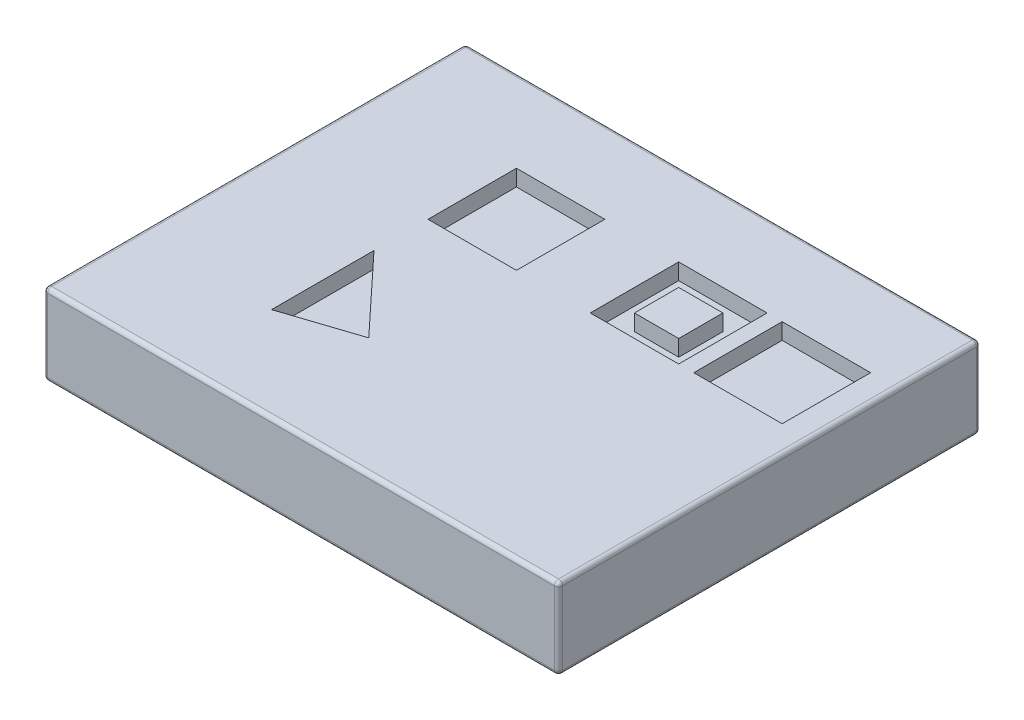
from build123d import *

# Parameters (mm, degrees)
SCHIZZO1_W                   = 63.465430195
SCHIZZO1_H                   = 52.006394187
ESTRUSIONE_ESTRUSIONE1_DEPTH = 10
SCHIZZO3_W                   = 10.899543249
SCHIZZO3_H                   = 10.899543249
SCHIZZO3_W_2                 = 5.449771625
SCHIZZO3_H_2                 = 5.449771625
SCHIZZO3_W_3                 = 10.89954325
TAGLIO_ESTRUSIONE1_DEPTH     = 2
RACCORDO3_R                  = 0.5


with BuildPart() as part:
    # Schizzo1 → Estrusione-Estrusione1 (new body)
    with BuildSketch(Plane(origin=(0, 0, 0), x_dir=(1, 0, 0), z_dir=(0, 1, 0))):
        with Locations((31.732715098, 26.003197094)):
            Rectangle(SCHIZZO1_W, SCHIZZO1_H)
    extrude(amount=ESTRUSIONE_ESTRUSIONE1_DEPTH)

    # Schizzo3 → Taglio-Estrusione1 (cut)
    # profile 1 of 4: a face of its own
    with BuildSketch(Plane(origin=(0, 10, 0), x_dir=(1, 0, 0), z_dir=(0, 1, 0))):
        with Locations((21.984557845, 36.298134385)):
            Rectangle(SCHIZZO3_W, SCHIZZO3_H)
    # profile 2 of 4: a face of its own
    with BuildSketch(Plane(origin=(0, 10, 0), x_dir=(1, 0, 0), z_dir=(0, 1, 0))):
        with Locations((41.984557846, 36.298134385)):
            Rectangle(SCHIZZO3_W, SCHIZZO3_H)
        with Locations((41.984557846, 36.298134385)):
            Rectangle(SCHIZZO3_W_2, SCHIZZO3_H_2, mode=Mode.SUBTRACT)
    # profile 3 of 4: a face of its own
    with BuildSketch(Plane(origin=(0, 10, 0), x_dir=(1, 0, 0), z_dir=(0, 1, 0))):
        Polygon((16.534786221, 11.562513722), (16.534786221, 24.191287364), (25.538140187, 14.538250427), align=None)
    # profile 4 of 4: a face of its own
    with BuildSketch(Plane(origin=(0, 10, 0), x_dir=(1, 0, 0), z_dir=(0, 1, 0))):
        with Locations((54.738899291, 36.298134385)):
            Rectangle(SCHIZZO3_W_3, SCHIZZO3_H)
    extrude(amount=-TAGLIO_ESTRUSIONE1_DEPTH, mode=Mode.SUBTRACT)

    # Raccordo3
    raccordo3_edges = [part.edges().sort_by_distance(p)[0] for p in [
        (63.465430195, 10, -26.003197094),
        (31.732715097, 10, -52.006394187),
        (0, 10, -26.003197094),
        (31.732715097, 0, -52.006394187),
        (63.465430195, 0, -26.003197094),
        (31.732715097, 0, 0),
        (0, 0, -26.003197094),
        (31.732715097, 10, 0),
        (0, 5, -52.006394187),
        (63.465430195, 5, -52.006394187),
        (63.465430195, 5, 0),
        (0, 5, 0),
    ]]
    fillet(raccordo3_edges, radius=RACCORDO3_R)


solid = part.part
